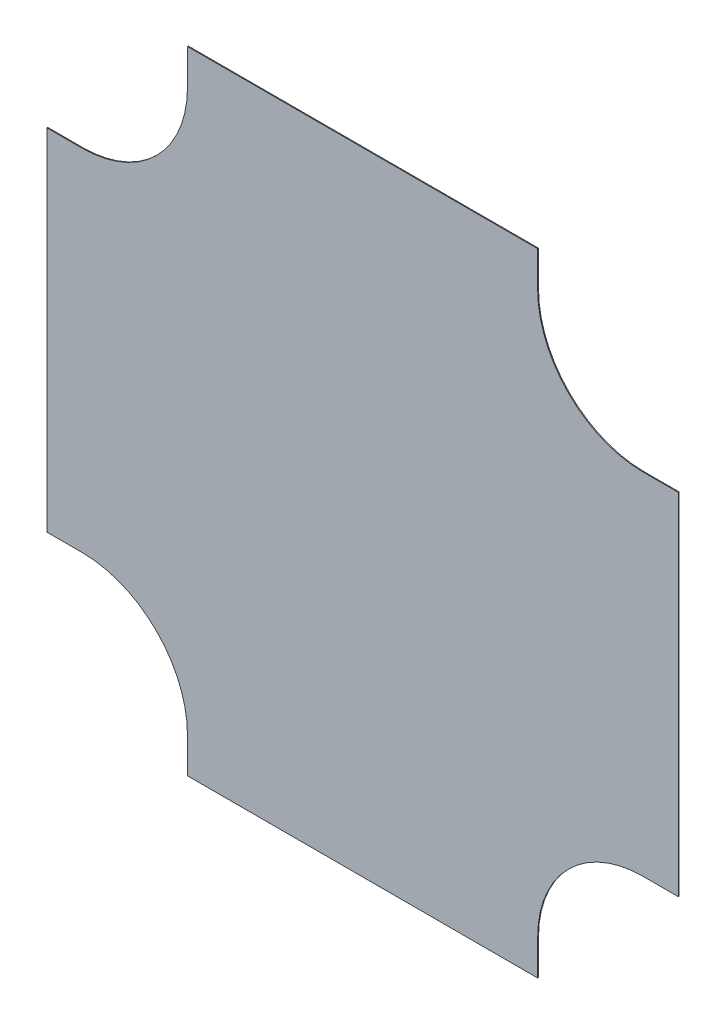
ISO-10303-21;
HEADER;
FILE_DESCRIPTION(('STEP AP214'),'2;1');
FILE_NAME('part.step','',(''),(''),'','','');
FILE_SCHEMA(('AUTOMOTIVE_DESIGN { 1 0 10303 214 1 1 1 1 }'));
ENDSEC;
DATA;
#1=APPLICATION_CONTEXT('core data for automotive mechanical design processes');
#2=APPLICATION_PROTOCOL_DEFINITION('international standard','automotive_design',2000,#1);
#3=PRODUCT_CONTEXT('',#1,'mechanical');
#4=PRODUCT('Part','Part','',(#3));
#5=PRODUCT_RELATED_PRODUCT_CATEGORY('part','',(#4));
#6=PRODUCT_DEFINITION_FORMATION('','',#4);
#7=PRODUCT_DEFINITION_CONTEXT('part definition',#1,'design');
#8=PRODUCT_DEFINITION('design','',#6,#7);
#9=PRODUCT_DEFINITION_SHAPE('','',#8);
#10=(LENGTH_UNIT() NAMED_UNIT(*) SI_UNIT(.MILLI.,.METRE.));
#11=(NAMED_UNIT(*) PLANE_ANGLE_UNIT() SI_UNIT($,.RADIAN.));
#12=(NAMED_UNIT(*) SI_UNIT($,.STERADIAN.) SOLID_ANGLE_UNIT());
#13=UNCERTAINTY_MEASURE_WITH_UNIT(LENGTH_MEASURE(1.E-05),#10,'distance_accuracy_value','');
#14=(GEOMETRIC_REPRESENTATION_CONTEXT(3) GLOBAL_UNCERTAINTY_ASSIGNED_CONTEXT((#13)) GLOBAL_UNIT_ASSIGNED_CONTEXT((#10,
#11,#12)) REPRESENTATION_CONTEXT('',''));
#15=CARTESIAN_POINT('',(0.,0.,0.));
#16=DIRECTION('',(0.,0.,1.));
#17=DIRECTION('',(1.,0.,0.));
#18=AXIS2_PLACEMENT_3D('',#15,#16,#17);
#19=CARTESIAN_POINT('',(0.,50.,1.21412));
#20=DIRECTION('',(1.,0.,0.));
#21=DIRECTION('',(0.,1.,0.));
#22=AXIS2_PLACEMENT_3D('',#19,#20,#21);
#23=PLANE('',#22);
#24=DIRECTION('',(0.,-1.,0.));
#25=VECTOR('',#24,1.);
#26=CARTESIAN_POINT('',(0.,50.,0.));
#27=LINE('',#26,#25);
#28=CARTESIAN_POINT('',(0.,50.,0.));
#29=VERTEX_POINT('',#28);
#30=CARTESIAN_POINT('',(0.,0.,0.));
#31=VERTEX_POINT('',#30);
#32=EDGE_CURVE('E176',#29,#31,#27,.T.);
#33=ORIENTED_EDGE('',*,*,#32,.T.);
#34=DIRECTION('',(0.,0.,-1.));
#35=VECTOR('',#34,1.);
#36=CARTESIAN_POINT('',(0.,0.,1.21412));
#37=LINE('',#36,#35);
#38=CARTESIAN_POINT('',(0.,0.,1.21412));
#39=VERTEX_POINT('',#38);
#40=EDGE_CURVE('E11',#39,#31,#37,.T.);
#41=ORIENTED_EDGE('',*,*,#40,.F.);
#42=DIRECTION('',(0.,-1.,0.));
#43=VECTOR('',#42,1.);
#44=CARTESIAN_POINT('',(0.,50.,1.21412));
#45=LINE('',#44,#43);
#46=CARTESIAN_POINT('',(0.,50.,1.21412));
#47=VERTEX_POINT('',#46);
#48=EDGE_CURVE('E206',#47,#39,#45,.T.);
#49=ORIENTED_EDGE('',*,*,#48,.F.);
#50=DIRECTION('',(0.,0.,-1.));
#51=VECTOR('',#50,1.);
#52=CARTESIAN_POINT('',(0.,50.,1.21412));
#53=LINE('',#52,#51);
#54=EDGE_CURVE('E172',#47,#29,#53,.T.);
#55=ORIENTED_EDGE('',*,*,#54,.T.);
#56=EDGE_LOOP('',(#33,#41,#49,#55));
#57=FACE_BOUND('',#56,.T.);
#58=ADVANCED_FACE('F32',(#57),#23,.F.);
#59=CARTESIAN_POINT('',(0.,0.,1.21412));
#60=DIRECTION('',(0.,1.,0.));
#61=DIRECTION('',(0.,0.,1.));
#62=AXIS2_PLACEMENT_3D('',#59,#60,#61);
#63=PLANE('',#62);
#64=DIRECTION('',(1.,0.,0.));
#65=VECTOR('',#64,1.);
#66=CARTESIAN_POINT('',(0.,0.,0.));
#67=LINE('',#66,#65);
#68=CARTESIAN_POINT('',(497.572,0.,0.));
#69=VERTEX_POINT('',#68);
#70=EDGE_CURVE('E179',#31,#69,#67,.T.);
#71=ORIENTED_EDGE('',*,*,#70,.T.);
#72=DIRECTION('',(0.,0.,-1.));
#73=VECTOR('',#72,1.);
#74=CARTESIAN_POINT('',(497.572,0.,1.21412));
#75=LINE('',#74,#73);
#76=CARTESIAN_POINT('',(497.572,0.,1.21412));
#77=VERTEX_POINT('',#76);
#78=EDGE_CURVE('E40',#77,#69,#75,.T.);
#79=ORIENTED_EDGE('',*,*,#78,.F.);
#80=DIRECTION('',(1.,0.,0.));
#81=VECTOR('',#80,1.);
#82=CARTESIAN_POINT('',(0.,0.,1.21412));
#83=LINE('',#82,#81);
#84=EDGE_CURVE('E115',#39,#77,#83,.T.);
#85=ORIENTED_EDGE('',*,*,#84,.F.);
#86=ORIENTED_EDGE('',*,*,#40,.T.);
#87=EDGE_LOOP('',(#71,#79,#85,#86));
#88=FACE_BOUND('',#87,.T.);
#89=ADVANCED_FACE('F304',(#88),#63,.F.);
#90=CARTESIAN_POINT('',(497.572,0.,1.21412));
#91=DIRECTION('',(-1.,0.,0.));
#92=DIRECTION('',(0.,0.,1.));
#93=AXIS2_PLACEMENT_3D('',#90,#91,#92);
#94=PLANE('',#93);
#95=DIRECTION('',(0.,1.,0.));
#96=VECTOR('',#95,1.);
#97=CARTESIAN_POINT('',(497.572,0.,0.));
#98=LINE('',#97,#96);
#99=CARTESIAN_POINT('',(497.572,50.,0.));
#100=VERTEX_POINT('',#99);
#101=EDGE_CURVE('E181',#69,#100,#98,.T.);
#102=ORIENTED_EDGE('',*,*,#101,.T.);
#103=DIRECTION('',(0.,0.,-1.));
#104=VECTOR('',#103,1.);
#105=CARTESIAN_POINT('',(497.572,50.,1.21412));
#106=LINE('',#105,#104);
#107=CARTESIAN_POINT('',(497.572,50.,1.21412));
#108=VERTEX_POINT('',#107);
#109=EDGE_CURVE('E237',#108,#100,#106,.T.);
#110=ORIENTED_EDGE('',*,*,#109,.F.);
#111=DIRECTION('',(0.,1.,0.));
#112=VECTOR('',#111,1.);
#113=CARTESIAN_POINT('',(497.572,0.,1.21412));
#114=LINE('',#113,#112);
#115=EDGE_CURVE('E245',#77,#108,#114,.T.);
#116=ORIENTED_EDGE('',*,*,#115,.F.);
#117=ORIENTED_EDGE('',*,*,#78,.T.);
#118=EDGE_LOOP('',(#102,#110,#116,#117));
#119=FACE_BOUND('',#118,.T.);
#120=ADVANCED_FACE('F243',(#119),#94,.F.);
#121=CARTESIAN_POINT('',(647.572,50.,1.21412));
#122=DIRECTION('',(0.,0.,-1.));
#123=DIRECTION('',(-1.,0.,0.));
#124=AXIS2_PLACEMENT_3D('',#121,#122,#123);
#125=CYLINDRICAL_SURFACE('',#124,150.);
#126=CARTESIAN_POINT('',(647.572,50.,0.));
#127=DIRECTION('',(0.,0.,-1.));
#128=DIRECTION('',(-1.,0.,0.));
#129=AXIS2_PLACEMENT_3D('',#126,#127,#128);
#130=CIRCLE('',#129,150.);
#131=CARTESIAN_POINT('',(647.572,200.,0.));
#132=VERTEX_POINT('',#131);
#133=EDGE_CURVE('E183',#100,#132,#130,.T.);
#134=ORIENTED_EDGE('',*,*,#133,.T.);
#135=DIRECTION('',(0.,0.,-1.));
#136=VECTOR('',#135,1.);
#137=CARTESIAN_POINT('',(647.572,200.,1.21412));
#138=LINE('',#137,#136);
#139=CARTESIAN_POINT('',(647.572,200.,1.21412));
#140=VERTEX_POINT('',#139);
#141=EDGE_CURVE('E234',#140,#132,#138,.T.);
#142=ORIENTED_EDGE('',*,*,#141,.F.);
#143=CARTESIAN_POINT('',(647.572,50.,1.21412));
#144=DIRECTION('',(0.,0.,-1.));
#145=DIRECTION('',(-1.,0.,0.));
#146=AXIS2_PLACEMENT_3D('',#143,#144,#145);
#147=CIRCLE('',#146,150.);
#148=EDGE_CURVE('E263',#108,#140,#147,.T.);
#149=ORIENTED_EDGE('',*,*,#148,.F.);
#150=ORIENTED_EDGE('',*,*,#109,.T.);
#151=EDGE_LOOP('',(#134,#142,#149,#150));
#152=FACE_BOUND('',#151,.T.);
#153=ADVANCED_FACE('F254',(#152),#125,.F.);
#154=CARTESIAN_POINT('',(647.572,200.,1.21412));
#155=DIRECTION('',(0.,1.,0.));
#156=DIRECTION('',(0.,0.,1.));
#157=AXIS2_PLACEMENT_3D('',#154,#155,#156);
#158=PLANE('',#157);
#159=DIRECTION('',(1.,0.,0.));
#160=VECTOR('',#159,1.);
#161=CARTESIAN_POINT('',(647.572,200.,0.));
#162=LINE('',#161,#160);
#163=CARTESIAN_POINT('',(697.572,200.,0.));
#164=VERTEX_POINT('',#163);
#165=EDGE_CURVE('E185',#132,#164,#162,.T.);
#166=ORIENTED_EDGE('',*,*,#165,.T.);
#167=DIRECTION('',(0.,0.,-1.));
#168=VECTOR('',#167,1.);
#169=CARTESIAN_POINT('',(697.572,200.,1.21412));
#170=LINE('',#169,#168);
#171=CARTESIAN_POINT('',(697.572,200.,1.21412));
#172=VERTEX_POINT('',#171);
#173=EDGE_CURVE('E231',#172,#164,#170,.T.);
#174=ORIENTED_EDGE('',*,*,#173,.F.);
#175=DIRECTION('',(1.,0.,0.));
#176=VECTOR('',#175,1.);
#177=CARTESIAN_POINT('',(647.572,200.,1.21412));
#178=LINE('',#177,#176);
#179=EDGE_CURVE('E260',#140,#172,#178,.T.);
#180=ORIENTED_EDGE('',*,*,#179,.F.);
#181=ORIENTED_EDGE('',*,*,#141,.T.);
#182=EDGE_LOOP('',(#166,#174,#180,#181));
#183=FACE_BOUND('',#182,.T.);
#184=ADVANCED_FACE('F258',(#183),#158,.F.);
#185=CARTESIAN_POINT('',(697.572,200.,1.21412));
#186=DIRECTION('',(-1.,0.,0.));
#187=DIRECTION('',(0.,0.,1.));
#188=AXIS2_PLACEMENT_3D('',#185,#186,#187);
#189=PLANE('',#188);
#190=DIRECTION('',(0.,1.,0.));
#191=VECTOR('',#190,1.);
#192=CARTESIAN_POINT('',(697.572,200.,0.));
#193=LINE('',#192,#191);
#194=CARTESIAN_POINT('',(697.572,697.572,0.));
#195=VERTEX_POINT('',#194);
#196=EDGE_CURVE('E187',#164,#195,#193,.T.);
#197=ORIENTED_EDGE('',*,*,#196,.T.);
#198=DIRECTION('',(0.,0.,-1.));
#199=VECTOR('',#198,1.);
#200=CARTESIAN_POINT('',(697.572,697.572,1.21412));
#201=LINE('',#200,#199);
#202=CARTESIAN_POINT('',(697.572,697.572,1.21412));
#203=VERTEX_POINT('',#202);
#204=EDGE_CURVE('E228',#203,#195,#201,.T.);
#205=ORIENTED_EDGE('',*,*,#204,.F.);
#206=DIRECTION('',(0.,1.,0.));
#207=VECTOR('',#206,1.);
#208=CARTESIAN_POINT('',(697.572,200.,1.21412));
#209=LINE('',#208,#207);
#210=EDGE_CURVE('E262',#172,#203,#209,.T.);
#211=ORIENTED_EDGE('',*,*,#210,.F.);
#212=ORIENTED_EDGE('',*,*,#173,.T.);
#213=EDGE_LOOP('',(#197,#205,#211,#212));
#214=FACE_BOUND('',#213,.T.);
#215=ADVANCED_FACE('F317',(#214),#189,.F.);
#216=CARTESIAN_POINT('',(697.572,697.572,1.21412));
#217=DIRECTION('',(0.,-1.,0.));
#218=DIRECTION('',(0.,0.,-1.));
#219=AXIS2_PLACEMENT_3D('',#216,#217,#218);
#220=PLANE('',#219);
#221=DIRECTION('',(-1.,0.,0.));
#222=VECTOR('',#221,1.);
#223=CARTESIAN_POINT('',(697.572,697.572,0.));
#224=LINE('',#223,#222);
#225=CARTESIAN_POINT('',(647.572,697.572,0.));
#226=VERTEX_POINT('',#225);
#227=EDGE_CURVE('E189',#195,#226,#224,.T.);
#228=ORIENTED_EDGE('',*,*,#227,.T.);
#229=DIRECTION('',(0.,0.,-1.));
#230=VECTOR('',#229,1.);
#231=CARTESIAN_POINT('',(647.572,697.572,1.21412));
#232=LINE('',#231,#230);
#233=CARTESIAN_POINT('',(647.572,697.572,1.21412));
#234=VERTEX_POINT('',#233);
#235=EDGE_CURVE('E225',#234,#226,#232,.T.);
#236=ORIENTED_EDGE('',*,*,#235,.F.);
#237=DIRECTION('',(-1.,0.,0.));
#238=VECTOR('',#237,1.);
#239=CARTESIAN_POINT('',(697.572,697.572,1.21412));
#240=LINE('',#239,#238);
#241=EDGE_CURVE('E265',#203,#234,#240,.T.);
#242=ORIENTED_EDGE('',*,*,#241,.F.);
#243=ORIENTED_EDGE('',*,*,#204,.T.);
#244=EDGE_LOOP('',(#228,#236,#242,#243));
#245=FACE_BOUND('',#244,.T.);
#246=ADVANCED_FACE('F320',(#245),#220,.F.);
#247=CARTESIAN_POINT('',(647.572,847.572,1.21412));
#248=DIRECTION('',(0.,0.,-1.));
#249=DIRECTION('',(-1.,0.,0.));
#250=AXIS2_PLACEMENT_3D('',#247,#248,#249);
#251=CYLINDRICAL_SURFACE('',#250,150.);
#252=CARTESIAN_POINT('',(647.572,847.572,0.));
#253=DIRECTION('',(0.,0.,-1.));
#254=DIRECTION('',(-1.,0.,0.));
#255=AXIS2_PLACEMENT_3D('',#252,#253,#254);
#256=CIRCLE('',#255,150.);
#257=CARTESIAN_POINT('',(497.572,847.572,0.));
#258=VERTEX_POINT('',#257);
#259=EDGE_CURVE('E191',#226,#258,#256,.T.);
#260=ORIENTED_EDGE('',*,*,#259,.T.);
#261=DIRECTION('',(0.,0.,-1.));
#262=VECTOR('',#261,1.);
#263=CARTESIAN_POINT('',(497.572,847.572,1.21412));
#264=LINE('',#263,#262);
#265=CARTESIAN_POINT('',(497.572,847.572,1.21412));
#266=VERTEX_POINT('',#265);
#267=EDGE_CURVE('E222',#266,#258,#264,.T.);
#268=ORIENTED_EDGE('',*,*,#267,.F.);
#269=CARTESIAN_POINT('',(647.572,847.572,1.21412));
#270=DIRECTION('',(0.,0.,-1.));
#271=DIRECTION('',(-1.,0.,0.));
#272=AXIS2_PLACEMENT_3D('',#269,#270,#271);
#273=CIRCLE('',#272,150.);
#274=EDGE_CURVE('E271',#234,#266,#273,.T.);
#275=ORIENTED_EDGE('',*,*,#274,.F.);
#276=ORIENTED_EDGE('',*,*,#235,.T.);
#277=EDGE_LOOP('',(#260,#268,#275,#276));
#278=FACE_BOUND('',#277,.T.);
#279=ADVANCED_FACE('F324',(#278),#251,.F.);
#280=CARTESIAN_POINT('',(497.572,847.572,1.21412));
#281=DIRECTION('',(-1.,0.,0.));
#282=DIRECTION('',(0.,0.,1.));
#283=AXIS2_PLACEMENT_3D('',#280,#281,#282);
#284=PLANE('',#283);
#285=DIRECTION('',(0.,1.,0.));
#286=VECTOR('',#285,1.);
#287=CARTESIAN_POINT('',(497.572,847.572,0.));
#288=LINE('',#287,#286);
#289=CARTESIAN_POINT('',(497.572,897.572,0.));
#290=VERTEX_POINT('',#289);
#291=EDGE_CURVE('E193',#258,#290,#288,.T.);
#292=ORIENTED_EDGE('',*,*,#291,.T.);
#293=DIRECTION('',(0.,0.,-1.));
#294=VECTOR('',#293,1.);
#295=CARTESIAN_POINT('',(497.572,897.572,1.21412));
#296=LINE('',#295,#294);
#297=CARTESIAN_POINT('',(497.572,897.572,1.21412));
#298=VERTEX_POINT('',#297);
#299=EDGE_CURVE('E219',#298,#290,#296,.T.);
#300=ORIENTED_EDGE('',*,*,#299,.F.);
#301=DIRECTION('',(0.,1.,0.));
#302=VECTOR('',#301,1.);
#303=CARTESIAN_POINT('',(497.572,847.572,1.21412));
#304=LINE('',#303,#302);
#305=EDGE_CURVE('E273',#266,#298,#304,.T.);
#306=ORIENTED_EDGE('',*,*,#305,.F.);
#307=ORIENTED_EDGE('',*,*,#267,.T.);
#308=EDGE_LOOP('',(#292,#300,#306,#307));
#309=FACE_BOUND('',#308,.T.);
#310=ADVANCED_FACE('F328',(#309),#284,.F.);
#311=CARTESIAN_POINT('',(497.572,897.572,1.21412));
#312=DIRECTION('',(0.,-1.,0.));
#313=DIRECTION('',(0.,0.,-1.));
#314=AXIS2_PLACEMENT_3D('',#311,#312,#313);
#315=PLANE('',#314);
#316=DIRECTION('',(-1.,0.,0.));
#317=VECTOR('',#316,1.);
#318=CARTESIAN_POINT('',(497.572,897.572,0.));
#319=LINE('',#318,#317);
#320=CARTESIAN_POINT('',(0.,897.572,0.));
#321=VERTEX_POINT('',#320);
#322=EDGE_CURVE('E195',#290,#321,#319,.T.);
#323=ORIENTED_EDGE('',*,*,#322,.T.);
#324=DIRECTION('',(0.,0.,-1.));
#325=VECTOR('',#324,1.);
#326=CARTESIAN_POINT('',(0.,897.572,1.21412));
#327=LINE('',#326,#325);
#328=CARTESIAN_POINT('',(0.,897.572,1.21412));
#329=VERTEX_POINT('',#328);
#330=EDGE_CURVE('E216',#329,#321,#327,.T.);
#331=ORIENTED_EDGE('',*,*,#330,.F.);
#332=DIRECTION('',(-1.,0.,0.));
#333=VECTOR('',#332,1.);
#334=CARTESIAN_POINT('',(497.572,897.572,1.21412));
#335=LINE('',#334,#333);
#336=EDGE_CURVE('E275',#298,#329,#335,.T.);
#337=ORIENTED_EDGE('',*,*,#336,.F.);
#338=ORIENTED_EDGE('',*,*,#299,.T.);
#339=EDGE_LOOP('',(#323,#331,#337,#338));
#340=FACE_BOUND('',#339,.T.);
#341=ADVANCED_FACE('F332',(#340),#315,.F.);
#342=CARTESIAN_POINT('',(0.,897.572,1.21412));
#343=DIRECTION('',(1.,0.,0.));
#344=DIRECTION('',(0.,0.,-1.));
#345=AXIS2_PLACEMENT_3D('',#342,#343,#344);
#346=PLANE('',#345);
#347=DIRECTION('',(0.,-1.,0.));
#348=VECTOR('',#347,1.);
#349=CARTESIAN_POINT('',(0.,897.572,0.));
#350=LINE('',#349,#348);
#351=CARTESIAN_POINT('',(0.,847.572,0.));
#352=VERTEX_POINT('',#351);
#353=EDGE_CURVE('E197',#321,#352,#350,.T.);
#354=ORIENTED_EDGE('',*,*,#353,.T.);
#355=DIRECTION('',(0.,0.,-1.));
#356=VECTOR('',#355,1.);
#357=CARTESIAN_POINT('',(0.,847.572,1.21412));
#358=LINE('',#357,#356);
#359=CARTESIAN_POINT('',(0.,847.572,1.21412));
#360=VERTEX_POINT('',#359);
#361=EDGE_CURVE('E213',#360,#352,#358,.T.);
#362=ORIENTED_EDGE('',*,*,#361,.F.);
#363=DIRECTION('',(0.,-1.,0.));
#364=VECTOR('',#363,1.);
#365=CARTESIAN_POINT('',(0.,897.572,1.21412));
#366=LINE('',#365,#364);
#367=EDGE_CURVE('E277',#329,#360,#366,.T.);
#368=ORIENTED_EDGE('',*,*,#367,.F.);
#369=ORIENTED_EDGE('',*,*,#330,.T.);
#370=EDGE_LOOP('',(#354,#362,#368,#369));
#371=FACE_BOUND('',#370,.T.);
#372=ADVANCED_FACE('F336',(#371),#346,.F.);
#373=CARTESIAN_POINT('',(-150.,847.572,1.21412));
#374=DIRECTION('',(0.,0.,-1.));
#375=DIRECTION('',(-1.,0.,0.));
#376=AXIS2_PLACEMENT_3D('',#373,#374,#375);
#377=CYLINDRICAL_SURFACE('',#376,150.);
#378=CARTESIAN_POINT('',(-150.,847.572,0.));
#379=DIRECTION('',(0.,0.,-1.));
#380=DIRECTION('',(-1.,0.,0.));
#381=AXIS2_PLACEMENT_3D('',#378,#379,#380);
#382=CIRCLE('',#381,150.);
#383=CARTESIAN_POINT('',(-150.,697.572,0.));
#384=VERTEX_POINT('',#383);
#385=EDGE_CURVE('E199',#352,#384,#382,.T.);
#386=ORIENTED_EDGE('',*,*,#385,.T.);
#387=DIRECTION('',(0.,0.,-1.));
#388=VECTOR('',#387,1.);
#389=CARTESIAN_POINT('',(-150.,697.572,1.21412));
#390=LINE('',#389,#388);
#391=CARTESIAN_POINT('',(-150.,697.572,1.21412));
#392=VERTEX_POINT('',#391);
#393=EDGE_CURVE('E210',#392,#384,#390,.T.);
#394=ORIENTED_EDGE('',*,*,#393,.F.);
#395=CARTESIAN_POINT('',(-150.,847.572,1.21412));
#396=DIRECTION('',(0.,0.,-1.));
#397=DIRECTION('',(-1.,0.,0.));
#398=AXIS2_PLACEMENT_3D('',#395,#396,#397);
#399=CIRCLE('',#398,150.);
#400=EDGE_CURVE('E279',#360,#392,#399,.T.);
#401=ORIENTED_EDGE('',*,*,#400,.F.);
#402=ORIENTED_EDGE('',*,*,#361,.T.);
#403=EDGE_LOOP('',(#386,#394,#401,#402));
#404=FACE_BOUND('',#403,.T.);
#405=ADVANCED_FACE('F285',(#404),#377,.F.);
#406=CARTESIAN_POINT('',(-150.,697.572,1.21412));
#407=DIRECTION('',(0.,-1.,0.));
#408=DIRECTION('',(0.,0.,-1.));
#409=AXIS2_PLACEMENT_3D('',#406,#407,#408);
#410=PLANE('',#409);
#411=DIRECTION('',(-1.,0.,0.));
#412=VECTOR('',#411,1.);
#413=CARTESIAN_POINT('',(-150.,697.572,0.));
#414=LINE('',#413,#412);
#415=CARTESIAN_POINT('',(-200.,697.572,0.));
#416=VERTEX_POINT('',#415);
#417=EDGE_CURVE('E201',#384,#416,#414,.T.);
#418=ORIENTED_EDGE('',*,*,#417,.T.);
#419=DIRECTION('',(0.,0.,-1.));
#420=VECTOR('',#419,1.);
#421=CARTESIAN_POINT('',(-200.,697.572,1.21412));
#422=LINE('',#421,#420);
#423=CARTESIAN_POINT('',(-200.,697.572,1.21412));
#424=VERTEX_POINT('',#423);
#425=EDGE_CURVE('E167',#424,#416,#422,.T.);
#426=ORIENTED_EDGE('',*,*,#425,.F.);
#427=DIRECTION('',(-1.,0.,0.));
#428=VECTOR('',#427,1.);
#429=CARTESIAN_POINT('',(-150.,697.572,1.21412));
#430=LINE('',#429,#428);
#431=EDGE_CURVE('E158',#392,#424,#430,.T.);
#432=ORIENTED_EDGE('',*,*,#431,.F.);
#433=ORIENTED_EDGE('',*,*,#393,.T.);
#434=EDGE_LOOP('',(#418,#426,#432,#433));
#435=FACE_BOUND('',#434,.T.);
#436=ADVANCED_FACE('F289',(#435),#410,.F.);
#437=CARTESIAN_POINT('',(-200.,697.572,1.21412));
#438=DIRECTION('',(1.,0.,0.));
#439=DIRECTION('',(0.,0.,-1.));
#440=AXIS2_PLACEMENT_3D('',#437,#438,#439);
#441=PLANE('',#440);
#442=DIRECTION('',(0.,-1.,0.));
#443=VECTOR('',#442,1.);
#444=CARTESIAN_POINT('',(-200.,697.572,0.));
#445=LINE('',#444,#443);
#446=CARTESIAN_POINT('',(-200.,200.,0.));
#447=VERTEX_POINT('',#446);
#448=EDGE_CURVE('E166',#416,#447,#445,.T.);
#449=ORIENTED_EDGE('',*,*,#448,.T.);
#450=DIRECTION('',(0.,0.,-1.));
#451=VECTOR('',#450,1.);
#452=CARTESIAN_POINT('',(-200.,200.,1.21412));
#453=LINE('',#452,#451);
#454=CARTESIAN_POINT('',(-200.,200.,1.21412));
#455=VERTEX_POINT('',#454);
#456=EDGE_CURVE('E163',#455,#447,#453,.T.);
#457=ORIENTED_EDGE('',*,*,#456,.F.);
#458=DIRECTION('',(0.,-1.,0.));
#459=VECTOR('',#458,1.);
#460=CARTESIAN_POINT('',(-200.,697.572,1.21412));
#461=LINE('',#460,#459);
#462=EDGE_CURVE('E152',#424,#455,#461,.T.);
#463=ORIENTED_EDGE('',*,*,#462,.F.);
#464=ORIENTED_EDGE('',*,*,#425,.T.);
#465=EDGE_LOOP('',(#449,#457,#463,#464));
#466=FACE_BOUND('',#465,.T.);
#467=ADVANCED_FACE('F164',(#466),#441,.F.);
#468=CARTESIAN_POINT('',(-200.,200.,1.21412));
#469=DIRECTION('',(0.,1.,0.));
#470=DIRECTION('',(0.,0.,1.));
#471=AXIS2_PLACEMENT_3D('',#468,#469,#470);
#472=PLANE('',#471);
#473=DIRECTION('',(1.,0.,0.));
#474=VECTOR('',#473,1.);
#475=CARTESIAN_POINT('',(-200.,200.,0.));
#476=LINE('',#475,#474);
#477=CARTESIAN_POINT('',(-150.,200.,0.));
#478=VERTEX_POINT('',#477);
#479=EDGE_CURVE('E101',#447,#478,#476,.T.);
#480=ORIENTED_EDGE('',*,*,#479,.T.);
#481=DIRECTION('',(0.,0.,-1.));
#482=VECTOR('',#481,1.);
#483=CARTESIAN_POINT('',(-150.,200.,1.21412));
#484=LINE('',#483,#482);
#485=CARTESIAN_POINT('',(-150.,200.,1.21412));
#486=VERTEX_POINT('',#485);
#487=EDGE_CURVE('E168',#486,#478,#484,.T.);
#488=ORIENTED_EDGE('',*,*,#487,.F.);
#489=DIRECTION('',(1.,0.,0.));
#490=VECTOR('',#489,1.);
#491=CARTESIAN_POINT('',(-200.,200.,1.21412));
#492=LINE('',#491,#490);
#493=EDGE_CURVE('E156',#455,#486,#492,.T.);
#494=ORIENTED_EDGE('',*,*,#493,.F.);
#495=ORIENTED_EDGE('',*,*,#456,.T.);
#496=EDGE_LOOP('',(#480,#488,#494,#495));
#497=FACE_BOUND('',#496,.T.);
#498=ADVANCED_FACE('F170',(#497),#472,.F.);
#499=CARTESIAN_POINT('',(-150.,50.,1.21412));
#500=DIRECTION('',(0.,0.,-1.));
#501=DIRECTION('',(-1.,0.,0.));
#502=AXIS2_PLACEMENT_3D('',#499,#500,#501);
#503=CYLINDRICAL_SURFACE('',#502,150.);
#504=CARTESIAN_POINT('',(-150.,50.,0.));
#505=DIRECTION('',(0.,0.,-1.));
#506=DIRECTION('',(-1.,0.,0.));
#507=AXIS2_PLACEMENT_3D('',#504,#505,#506);
#508=CIRCLE('',#507,150.);
#509=EDGE_CURVE('E107',#478,#29,#508,.T.);
#510=ORIENTED_EDGE('',*,*,#509,.T.);
#511=ORIENTED_EDGE('',*,*,#54,.F.);
#512=CARTESIAN_POINT('',(-150.,50.,1.21412));
#513=DIRECTION('',(0.,0.,-1.));
#514=DIRECTION('',(-1.,0.,0.));
#515=AXIS2_PLACEMENT_3D('',#512,#513,#514);
#516=CIRCLE('',#515,150.);
#517=EDGE_CURVE('E48',#486,#47,#516,.T.);
#518=ORIENTED_EDGE('',*,*,#517,.F.);
#519=ORIENTED_EDGE('',*,*,#487,.T.);
#520=EDGE_LOOP('',(#510,#511,#518,#519));
#521=FACE_BOUND('',#520,.T.);
#522=ADVANCED_FACE('F293',(#521),#503,.F.);
#523=CARTESIAN_POINT('',(647.572,50.,1.21412));
#524=DIRECTION('',(0.,0.,-1.));
#525=DIRECTION('',(-1.,0.,0.));
#526=AXIS2_PLACEMENT_3D('',#523,#524,#525);
#527=PLANE('',#526);
#528=ORIENTED_EDGE('',*,*,#48,.T.);
#529=ORIENTED_EDGE('',*,*,#84,.T.);
#530=ORIENTED_EDGE('',*,*,#115,.T.);
#531=ORIENTED_EDGE('',*,*,#148,.T.);
#532=ORIENTED_EDGE('',*,*,#179,.T.);
#533=ORIENTED_EDGE('',*,*,#210,.T.);
#534=ORIENTED_EDGE('',*,*,#241,.T.);
#535=ORIENTED_EDGE('',*,*,#274,.T.);
#536=ORIENTED_EDGE('',*,*,#305,.T.);
#537=ORIENTED_EDGE('',*,*,#336,.T.);
#538=ORIENTED_EDGE('',*,*,#367,.T.);
#539=ORIENTED_EDGE('',*,*,#400,.T.);
#540=ORIENTED_EDGE('',*,*,#431,.T.);
#541=ORIENTED_EDGE('',*,*,#462,.T.);
#542=ORIENTED_EDGE('',*,*,#493,.T.);
#543=ORIENTED_EDGE('',*,*,#517,.T.);
#544=EDGE_LOOP('',(#528,#529,#530,#531,#532,#533,#534,#535,#536,#537,#538,#539,#540,#541,#542,#543));
#545=FACE_BOUND('',#544,.T.);
#546=ADVANCED_FACE('F154',(#545),#527,.F.);
#547=CARTESIAN_POINT('',(647.572,50.,0.));
#548=DIRECTION('',(0.,0.,-1.));
#549=DIRECTION('',(-1.,0.,0.));
#550=AXIS2_PLACEMENT_3D('',#547,#548,#549);
#551=PLANE('',#550);
#552=ORIENTED_EDGE('',*,*,#32,.F.);
#553=ORIENTED_EDGE('',*,*,#509,.F.);
#554=ORIENTED_EDGE('',*,*,#479,.F.);
#555=ORIENTED_EDGE('',*,*,#448,.F.);
#556=ORIENTED_EDGE('',*,*,#417,.F.);
#557=ORIENTED_EDGE('',*,*,#385,.F.);
#558=ORIENTED_EDGE('',*,*,#353,.F.);
#559=ORIENTED_EDGE('',*,*,#322,.F.);
#560=ORIENTED_EDGE('',*,*,#291,.F.);
#561=ORIENTED_EDGE('',*,*,#259,.F.);
#562=ORIENTED_EDGE('',*,*,#227,.F.);
#563=ORIENTED_EDGE('',*,*,#196,.F.);
#564=ORIENTED_EDGE('',*,*,#165,.F.);
#565=ORIENTED_EDGE('',*,*,#133,.F.);
#566=ORIENTED_EDGE('',*,*,#101,.F.);
#567=ORIENTED_EDGE('',*,*,#70,.F.);
#568=EDGE_LOOP('',(#552,#553,#554,#555,#556,#557,#558,#559,#560,#561,#562,#563,#564,#565,#566,#567));
#569=FACE_BOUND('',#568,.T.);
#570=ADVANCED_FACE('F249',(#569),#551,.T.);
#571=CLOSED_SHELL('',(#58,#89,#120,#153,#184,#215,#246,#279,#310,#341,#372,#405,#436,#467,#498,
#522,#546,#570));
#572=MANIFOLD_SOLID_BREP('B2',#571);
#573=ADVANCED_BREP_SHAPE_REPRESENTATION('',(#18,#572),#14);
#574=SHAPE_DEFINITION_REPRESENTATION(#9,#573);
ENDSEC;
END-ISO-10303-21;
